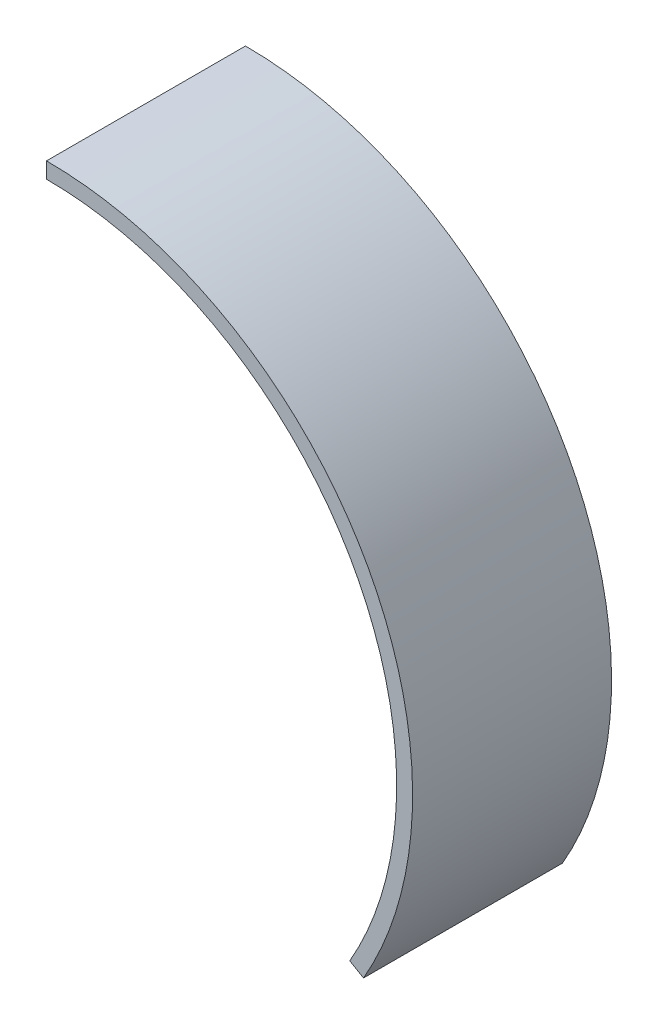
ISO-10303-21;
HEADER;
FILE_DESCRIPTION(('STEP AP214'),'2;1');
FILE_NAME('part.step','',(''),(''),'','','');
FILE_SCHEMA(('AUTOMOTIVE_DESIGN { 1 0 10303 214 1 1 1 1 }'));
ENDSEC;
DATA;
#1=APPLICATION_CONTEXT('core data for automotive mechanical design processes');
#2=APPLICATION_PROTOCOL_DEFINITION('international standard','automotive_design',2000,#1);
#3=PRODUCT_CONTEXT('',#1,'mechanical');
#4=PRODUCT('Part','Part','',(#3));
#5=PRODUCT_RELATED_PRODUCT_CATEGORY('part','',(#4));
#6=PRODUCT_DEFINITION_FORMATION('','',#4);
#7=PRODUCT_DEFINITION_CONTEXT('part definition',#1,'design');
#8=PRODUCT_DEFINITION('design','',#6,#7);
#9=PRODUCT_DEFINITION_SHAPE('','',#8);
#10=(LENGTH_UNIT() NAMED_UNIT(*) SI_UNIT(.MILLI.,.METRE.));
#11=(NAMED_UNIT(*) PLANE_ANGLE_UNIT() SI_UNIT($,.RADIAN.));
#12=(NAMED_UNIT(*) SI_UNIT($,.STERADIAN.) SOLID_ANGLE_UNIT());
#13=UNCERTAINTY_MEASURE_WITH_UNIT(LENGTH_MEASURE(1.E-05),#10,'distance_accuracy_value','');
#14=(GEOMETRIC_REPRESENTATION_CONTEXT(3) GLOBAL_UNCERTAINTY_ASSIGNED_CONTEXT((#13)) GLOBAL_UNIT_ASSIGNED_CONTEXT((#10,
#11,#12)) REPRESENTATION_CONTEXT('',''));
#15=CARTESIAN_POINT('',(0.,0.,0.));
#16=DIRECTION('',(0.,0.,1.));
#17=DIRECTION('',(1.,0.,0.));
#18=AXIS2_PLACEMENT_3D('',#15,#16,#17);
#19=CARTESIAN_POINT('',(0.,0.,25.));
#20=DIRECTION('',(0.,0.,-1.));
#21=DIRECTION('',(-1.,0.,0.));
#22=AXIS2_PLACEMENT_3D('',#19,#20,#21);
#23=CYLINDRICAL_SURFACE('',#22,44.);
#24=CARTESIAN_POINT('',(0.,0.,0.));
#25=DIRECTION('',(0.,0.,-1.));
#26=DIRECTION('',(1.,0.,0.));
#27=AXIS2_PLACEMENT_3D('',#24,#25,#26);
#28=CIRCLE('',#27,44.);
#29=CARTESIAN_POINT('',(0.,44.,0.));
#30=VERTEX_POINT('',#29);
#31=CARTESIAN_POINT('',(38.1051177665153,-21.9999999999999,0.));
#32=VERTEX_POINT('',#31);
#33=EDGE_CURVE('E69',#30,#32,#28,.T.);
#34=ORIENTED_EDGE('',*,*,#33,.T.);
#35=DIRECTION('',(0.,0.,-1.));
#36=VECTOR('',#35,1.);
#37=CARTESIAN_POINT('',(38.1051177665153,-21.9999999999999,25.));
#38=LINE('',#37,#36);
#39=CARTESIAN_POINT('',(38.1051177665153,-21.9999999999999,25.));
#40=VERTEX_POINT('',#39);
#41=EDGE_CURVE('E94',#40,#32,#38,.T.);
#42=ORIENTED_EDGE('',*,*,#41,.F.);
#43=CARTESIAN_POINT('',(0.,0.,25.));
#44=DIRECTION('',(0.,0.,-1.));
#45=DIRECTION('',(1.,0.,0.));
#46=AXIS2_PLACEMENT_3D('',#43,#44,#45);
#47=CIRCLE('',#46,44.);
#48=CARTESIAN_POINT('',(0.,44.,25.));
#49=VERTEX_POINT('',#48);
#50=EDGE_CURVE('E86',#49,#40,#47,.T.);
#51=ORIENTED_EDGE('',*,*,#50,.F.);
#52=DIRECTION('',(0.,0.,-1.));
#53=VECTOR('',#52,1.);
#54=CARTESIAN_POINT('',(0.,44.,25.));
#55=LINE('',#54,#53);
#56=EDGE_CURVE('E91',#49,#30,#55,.T.);
#57=ORIENTED_EDGE('',*,*,#56,.T.);
#58=EDGE_LOOP('',(#34,#42,#51,#57));
#59=FACE_BOUND('',#58,.T.);
#60=CARTESIAN_POINT('',(36.3465704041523,24.7977180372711,12.5000001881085));
#61=CARTESIAN_POINT('',(36.3465758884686,24.7977118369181,12.3149180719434));
#62=CARTESIAN_POINT('',(36.3554076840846,24.7847803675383,12.129708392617));
#63=CARTESIAN_POINT('',(36.3904263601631,24.733333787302,11.7644090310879));
#64=CARTESIAN_POINT('',(36.4166331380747,24.6947893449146,11.5843254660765));
#65=CARTESIAN_POINT('',(36.4853902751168,24.5930893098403,11.2346222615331));
#66=CARTESIAN_POINT('',(36.5279316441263,24.5299472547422,11.064996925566));
#67=CARTESIAN_POINT('',(36.6277508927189,24.3806457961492,10.740944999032));
#68=CARTESIAN_POINT('',(36.685025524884,24.2944914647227,10.586515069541));
#69=CARTESIAN_POINT('',(36.8123411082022,24.1011395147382,10.2968701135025));
#70=CARTESIAN_POINT('',(36.8824056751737,23.9939029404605,10.1616914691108));
#71=CARTESIAN_POINT('',(37.0327418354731,23.7612116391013,9.91469842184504));
#72=CARTESIAN_POINT('',(37.1130138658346,23.6357561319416,9.8028850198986));
#73=CARTESIAN_POINT('',(37.2811055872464,23.3697221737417,9.60567841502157));
#74=CARTESIAN_POINT('',(37.3689339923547,23.2291262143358,9.52031625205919));
#75=CARTESIAN_POINT('',(37.5491479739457,22.9366727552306,9.3786337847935));
#76=CARTESIAN_POINT('',(37.6415334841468,22.7848154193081,9.32231305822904));
#77=CARTESIAN_POINT('',(37.8277573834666,22.474284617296,9.24041548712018));
#78=CARTESIAN_POINT('',(37.9215926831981,22.3156246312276,9.21478051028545));
#79=CARTESIAN_POINT('',(38.1080734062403,21.995659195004,9.19480255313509));
#80=CARTESIAN_POINT('',(38.2007188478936,21.8343537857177,9.20045908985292));
#81=CARTESIAN_POINT('',(38.3820268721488,21.5140378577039,9.24285586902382));
#82=CARTESIAN_POINT('',(38.4706970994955,21.355023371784,9.27953349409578));
#83=CARTESIAN_POINT('',(38.6419403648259,21.0435749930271,9.38283408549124));
#84=CARTESIAN_POINT('',(38.7245133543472,20.8911411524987,9.4494572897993));
#85=CARTESIAN_POINT('',(38.8816545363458,20.5972030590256,9.61082777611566));
#86=CARTESIAN_POINT('',(38.9562146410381,20.4557098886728,9.70560311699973));
#87=CARTESIAN_POINT('',(39.0955893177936,20.188058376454,9.92056717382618));
#88=CARTESIAN_POINT('',(39.1604037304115,20.0619002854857,10.0407563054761));
#89=CARTESIAN_POINT('',(39.2791186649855,19.8284660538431,10.3034888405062));
#90=CARTESIAN_POINT('',(39.3329919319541,19.7212371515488,10.446086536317));
#91=CARTESIAN_POINT('',(39.428608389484,19.5293719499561,10.7493987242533));
#92=CARTESIAN_POINT('',(39.4703515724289,19.4447356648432,10.9101132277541));
#93=CARTESIAN_POINT('',(39.5409738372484,19.3007215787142,11.2451340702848));
#94=CARTESIAN_POINT('',(39.5698517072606,19.2413461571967,11.4194416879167));
#95=CARTESIAN_POINT('',(39.614249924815,19.1497732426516,11.7766832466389));
#96=CARTESIAN_POINT('',(39.6297704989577,19.1175752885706,11.9596170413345));
#97=CARTESIAN_POINT('',(39.6471792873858,19.0814460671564,12.3284420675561));
#98=CARTESIAN_POINT('',(39.6491005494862,19.0774462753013,12.5143250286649));
#99=CARTESIAN_POINT('',(39.639367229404,19.0976618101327,12.8841902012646));
#100=CARTESIAN_POINT('',(39.6277127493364,19.1218769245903,13.0681724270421));
#101=CARTESIAN_POINT('',(39.5910387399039,19.1976926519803,13.4287970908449));
#102=CARTESIAN_POINT('',(39.5660346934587,19.2492615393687,13.6054477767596));
#103=CARTESIAN_POINT('',(39.5030856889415,19.378114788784,13.9466499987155));
#104=CARTESIAN_POINT('',(39.4651405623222,19.4553994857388,14.1112013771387));
#105=CARTESIAN_POINT('',(39.3768796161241,19.6334205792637,14.4238818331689));
#106=CARTESIAN_POINT('',(39.3265401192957,19.7342018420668,14.571978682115));
#107=CARTESIAN_POINT('',(39.2144539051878,19.9560017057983,14.8472208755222));
#108=CARTESIAN_POINT('',(39.1527070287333,20.0770205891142,14.9743659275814));
#109=CARTESIAN_POINT('',(39.0188956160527,20.3358553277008,15.2043530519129));
#110=CARTESIAN_POINT('',(38.9468106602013,20.47370434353,15.3071459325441));
#111=CARTESIAN_POINT('',(38.7939781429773,20.7618356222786,15.4851736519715));
#112=CARTESIAN_POINT('',(38.713230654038,20.9121177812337,15.5604087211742));
#113=CARTESIAN_POINT('',(38.5450691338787,21.2204719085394,15.6810999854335));
#114=CARTESIAN_POINT('',(38.4576621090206,21.3785356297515,15.7265870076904));
#115=CARTESIAN_POINT('',(38.2783519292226,21.6979562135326,15.7865918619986));
#116=CARTESIAN_POINT('',(38.1864488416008,21.8593130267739,15.8011101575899));
#117=CARTESIAN_POINT('',(38.0009184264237,22.180272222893,15.7987605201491));
#118=CARTESIAN_POINT('',(37.9072958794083,22.3398779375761,15.781969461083));
#119=CARTESIAN_POINT('',(37.7208591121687,22.6532567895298,15.7176377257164));
#120=CARTESIAN_POINT('',(37.628044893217,22.8070299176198,15.6700970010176));
#121=CARTESIAN_POINT('',(37.4461083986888,23.1045318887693,15.5456339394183));
#122=CARTESIAN_POINT('',(37.3569860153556,23.2482610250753,15.4687124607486));
#123=CARTESIAN_POINT('',(37.1853272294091,23.5218526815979,15.2876808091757));
#124=CARTESIAN_POINT('',(37.1027906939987,23.6517154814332,15.1835711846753));
#125=CARTESIAN_POINT('',(36.9469088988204,23.8944935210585,14.9508305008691));
#126=CARTESIAN_POINT('',(36.8735855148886,24.0073685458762,14.8221428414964));
#127=CARTESIAN_POINT('',(36.7389201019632,24.2129489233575,14.5439934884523));
#128=CARTESIAN_POINT('',(36.6775809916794,24.3056493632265,14.3945267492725));
#129=CARTESIAN_POINT('',(36.5690521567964,24.4686341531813,14.0788246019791));
#130=CARTESIAN_POINT('',(36.521885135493,24.5388825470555,13.9125628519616));
#131=CARTESIAN_POINT('',(36.4436458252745,24.6549310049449,13.5682984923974));
#132=CARTESIAN_POINT('',(36.4125548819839,24.7007594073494,13.3903097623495));
#133=CARTESIAN_POINT('',(36.3756422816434,24.7550654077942,13.0927114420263));
#134=CARTESIAN_POINT('',(36.3647586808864,24.7710414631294,12.9750202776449));
#135=CARTESIAN_POINT('',(36.3502209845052,24.7923697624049,12.7382370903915));
#136=CARTESIAN_POINT('',(36.3465668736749,24.7977220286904,12.6191450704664));
#137=CARTESIAN_POINT('',(36.3465704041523,24.7977180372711,12.5000001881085));
#138=B_SPLINE_CURVE_WITH_KNOTS('',3,(#60,#61,#62,#63,#64,#65,#66,#67,#68,#69,#70,#71,#72,#73,
#74,#75,#76,#77,#78,#79,#80,#81,#82,#83,#84,#85,#86,#87,#88,#89,#90,#91,#92,#93,#94,#95,#96,#97,
#98,#99,#100,#101,#102,#103,#104,#105,#106,#107,#108,#109,#110,#111,#112,#113,#114,#115,#116,
#117,#118,#119,#120,#121,#122,#123,#124,#125,#126,#127,#128,#129,#130,#131,#132,#133,#134,#135,
#136,#137),.UNSPECIFIED.,.T.,.F.,(4,2,2,2,2,2,2,2,2,2,2,2,2,2,2,2,2,2,2,2,2,2,2,2,2,2,2,2,2,2,2,
2,2,2,2,2,2,2,4),(0.,0.554811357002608,1.1102591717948,1.66540172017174,2.22042201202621,
2.776477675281,3.33255715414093,3.88928673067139,4.44600821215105,5.0016733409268,
5.55732989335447,6.11186749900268,6.66640951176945,7.22150609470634,7.77661175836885,
8.33308370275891,8.88955599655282,9.44608069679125,10.0025959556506,10.5577583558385,
11.1129165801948,11.66743232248,12.2219552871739,12.7775459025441,13.3331442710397,
13.8898555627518,14.4465621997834,15.002691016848,15.5588115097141,16.113568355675,
16.6683260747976,17.2230675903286,17.7777979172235,18.3338214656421,18.8899802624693,
19.4470253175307,20.0034225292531,20.3605779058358,20.7177325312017),.UNSPECIFIED.);
#139=CARTESIAN_POINT('',(36.3465704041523,24.7977180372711,12.5000001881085));
#140=VERTEX_POINT('',#139);
#141=EDGE_CURVE('E11',#140,#140,#138,.T.);
#142=ORIENTED_EDGE('',*,*,#141,.F.);
#143=EDGE_LOOP('',(#142));
#144=FACE_BOUND('',#143,.T.);
#145=ADVANCED_FACE('F31',(#59,#144),#23,.F.);
#146=CARTESIAN_POINT('',(0.,0.,25.));
#147=DIRECTION('',(0.,0.,-1.));
#148=DIRECTION('',(-1.,0.,0.));
#149=AXIS2_PLACEMENT_3D('',#146,#147,#148);
#150=CYLINDRICAL_SURFACE('',#149,46.);
#151=CARTESIAN_POINT('',(0.,0.,0.));
#152=DIRECTION('',(0.,0.,1.));
#153=DIRECTION('',(1.,0.,0.));
#154=AXIS2_PLACEMENT_3D('',#151,#152,#153);
#155=CIRCLE('',#154,46.);
#156=CARTESIAN_POINT('',(39.8371685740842,-22.9999999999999,0.));
#157=VERTEX_POINT('',#156);
#158=CARTESIAN_POINT('',(0.,46.,0.));
#159=VERTEX_POINT('',#158);
#160=EDGE_CURVE('E102',#157,#159,#155,.T.);
#161=ORIENTED_EDGE('',*,*,#160,.T.);
#162=DIRECTION('',(0.,0.,-1.));
#163=VECTOR('',#162,1.);
#164=CARTESIAN_POINT('',(0.,46.,25.));
#165=LINE('',#164,#163);
#166=CARTESIAN_POINT('',(0.,46.,25.));
#167=VERTEX_POINT('',#166);
#168=EDGE_CURVE('E44',#167,#159,#165,.T.);
#169=ORIENTED_EDGE('',*,*,#168,.F.);
#170=CARTESIAN_POINT('',(0.,0.,25.));
#171=DIRECTION('',(0.,0.,1.));
#172=DIRECTION('',(1.,0.,0.));
#173=AXIS2_PLACEMENT_3D('',#170,#171,#172);
#174=CIRCLE('',#173,46.);
#175=CARTESIAN_POINT('',(39.8371685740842,-22.9999999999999,25.));
#176=VERTEX_POINT('',#175);
#177=EDGE_CURVE('E88',#176,#167,#174,.T.);
#178=ORIENTED_EDGE('',*,*,#177,.F.);
#179=DIRECTION('',(0.,0.,-1.));
#180=VECTOR('',#179,1.);
#181=CARTESIAN_POINT('',(39.8371685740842,-22.9999999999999,25.));
#182=LINE('',#181,#180);
#183=EDGE_CURVE('E98',#176,#157,#182,.T.);
#184=ORIENTED_EDGE('',*,*,#183,.T.);
#185=EDGE_LOOP('',(#161,#169,#178,#184));
#186=FACE_BOUND('',#185,.T.);
#187=ADVANCED_FACE('F33',(#186),#150,.T.);
#188=CARTESIAN_POINT('',(0.,46.,25.));
#189=DIRECTION('',(1.,0.,0.));
#190=DIRECTION('',(0.,1.,0.));
#191=AXIS2_PLACEMENT_3D('',#188,#189,#190);
#192=PLANE('',#191);
#193=DIRECTION('',(0.,-1.,0.));
#194=VECTOR('',#193,1.);
#195=CARTESIAN_POINT('',(0.,46.,0.));
#196=LINE('',#195,#194);
#197=EDGE_CURVE('E93',#159,#30,#196,.T.);
#198=ORIENTED_EDGE('',*,*,#197,.T.);
#199=ORIENTED_EDGE('',*,*,#56,.F.);
#200=DIRECTION('',(0.,-1.,0.));
#201=VECTOR('',#200,1.);
#202=CARTESIAN_POINT('',(0.,46.,25.));
#203=LINE('',#202,#201);
#204=EDGE_CURVE('E83',#167,#49,#203,.T.);
#205=ORIENTED_EDGE('',*,*,#204,.F.);
#206=ORIENTED_EDGE('',*,*,#168,.T.);
#207=EDGE_LOOP('',(#198,#199,#205,#206));
#208=FACE_BOUND('',#207,.T.);
#209=ADVANCED_FACE('F92',(#208),#192,.F.);
#210=CARTESIAN_POINT('',(38.1051177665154,-21.9999999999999,25.));
#211=DIRECTION('',(0.499999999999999,0.866025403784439,0.));
#212=DIRECTION('',(-0.866025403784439,0.499999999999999,0.));
#213=AXIS2_PLACEMENT_3D('',#210,#211,#212);
#214=PLANE('',#213);
#215=DIRECTION('',(0.866025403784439,-0.499999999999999,0.));
#216=VECTOR('',#215,1.);
#217=CARTESIAN_POINT('',(38.1051177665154,-21.9999999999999,0.));
#218=LINE('',#217,#216);
#219=EDGE_CURVE('E75',#32,#157,#218,.T.);
#220=ORIENTED_EDGE('',*,*,#219,.T.);
#221=ORIENTED_EDGE('',*,*,#183,.F.);
#222=DIRECTION('',(0.866025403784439,-0.499999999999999,0.));
#223=VECTOR('',#222,1.);
#224=CARTESIAN_POINT('',(38.1051177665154,-21.9999999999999,25.));
#225=LINE('',#224,#223);
#226=EDGE_CURVE('E52',#40,#176,#225,.T.);
#227=ORIENTED_EDGE('',*,*,#226,.F.);
#228=ORIENTED_EDGE('',*,*,#41,.T.);
#229=EDGE_LOOP('',(#220,#221,#227,#228));
#230=FACE_BOUND('',#229,.T.);
#231=ADVANCED_FACE('F123',(#230),#214,.F.);
#232=CARTESIAN_POINT('',(0.,0.,25.));
#233=DIRECTION('',(0.,0.,1.));
#234=DIRECTION('',(1.,0.,0.));
#235=AXIS2_PLACEMENT_3D('',#232,#233,#234);
#236=PLANE('',#235);
#237=ORIENTED_EDGE('',*,*,#177,.T.);
#238=ORIENTED_EDGE('',*,*,#204,.T.);
#239=ORIENTED_EDGE('',*,*,#50,.T.);
#240=ORIENTED_EDGE('',*,*,#226,.T.);
#241=EDGE_LOOP('',(#237,#238,#239,#240));
#242=FACE_BOUND('',#241,.T.);
#243=ADVANCED_FACE('F84',(#242),#236,.T.);
#244=CARTESIAN_POINT('',(0.,0.,0.));
#245=DIRECTION('',(0.,0.,1.));
#246=DIRECTION('',(1.,0.,0.));
#247=AXIS2_PLACEMENT_3D('',#244,#245,#246);
#248=PLANE('',#247);
#249=ORIENTED_EDGE('',*,*,#160,.F.);
#250=ORIENTED_EDGE('',*,*,#219,.F.);
#251=ORIENTED_EDGE('',*,*,#33,.F.);
#252=ORIENTED_EDGE('',*,*,#197,.F.);
#253=EDGE_LOOP('',(#249,#250,#251,#252));
#254=FACE_BOUND('',#253,.T.);
#255=ADVANCED_FACE('F113',(#254),#248,.F.);
#256=CARTESIAN_POINT('',(35.0729445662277,20.2518780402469,12.5000001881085));
#257=DIRECTION('',(0.866025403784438,0.500000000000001,0.));
#258=DIRECTION('',(-0.500000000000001,0.866025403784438,0.));
#259=AXIS2_PLACEMENT_3D('',#256,#257,#258);
#260=CYLINDRICAL_SURFACE('',#259,3.3);
#261=CARTESIAN_POINT('',(35.0729445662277,20.2518780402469,12.5000001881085));
#262=DIRECTION('',(-0.866025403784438,-0.500000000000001,0.));
#263=DIRECTION('',(0.500000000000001,-0.866025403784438,0.));
#264=AXIS2_PLACEMENT_3D('',#261,#262,#263);
#265=CIRCLE('',#264,3.3);
#266=CARTESIAN_POINT('',(36.7229445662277,17.3939942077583,12.5000001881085));
#267=VERTEX_POINT('',#266);
#268=EDGE_CURVE('E105',#267,#267,#265,.T.);
#269=ORIENTED_EDGE('',*,*,#268,.F.);
#270=EDGE_LOOP('',(#269));
#271=FACE_BOUND('',#270,.T.);
#272=ORIENTED_EDGE('',*,*,#141,.T.);
#273=EDGE_LOOP('',(#272));
#274=FACE_BOUND('',#273,.T.);
#275=ADVANCED_FACE('F115',(#271,#274),#260,.T.);
#276=CARTESIAN_POINT('',(35.0729445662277,20.2518780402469,12.5000001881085));
#277=DIRECTION('',(-0.866025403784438,-0.500000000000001,0.));
#278=DIRECTION('',(0.500000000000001,-0.866025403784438,0.));
#279=AXIS2_PLACEMENT_3D('',#276,#277,#278);
#280=PLANE('',#279);
#281=ORIENTED_EDGE('',*,*,#268,.T.);
#282=EDGE_LOOP('',(#281));
#283=FACE_BOUND('',#282,.T.);
#284=ADVANCED_FACE('F121',(#283),#280,.T.);
#285=CLOSED_SHELL('',(#145,#187,#209,#231,#243,#255,#275,#284));
#286=MANIFOLD_SOLID_BREP('B2',#285);
#287=ADVANCED_BREP_SHAPE_REPRESENTATION('',(#18,#286),#14);
#288=SHAPE_DEFINITION_REPRESENTATION(#9,#287);
ENDSEC;
END-ISO-10303-21;
